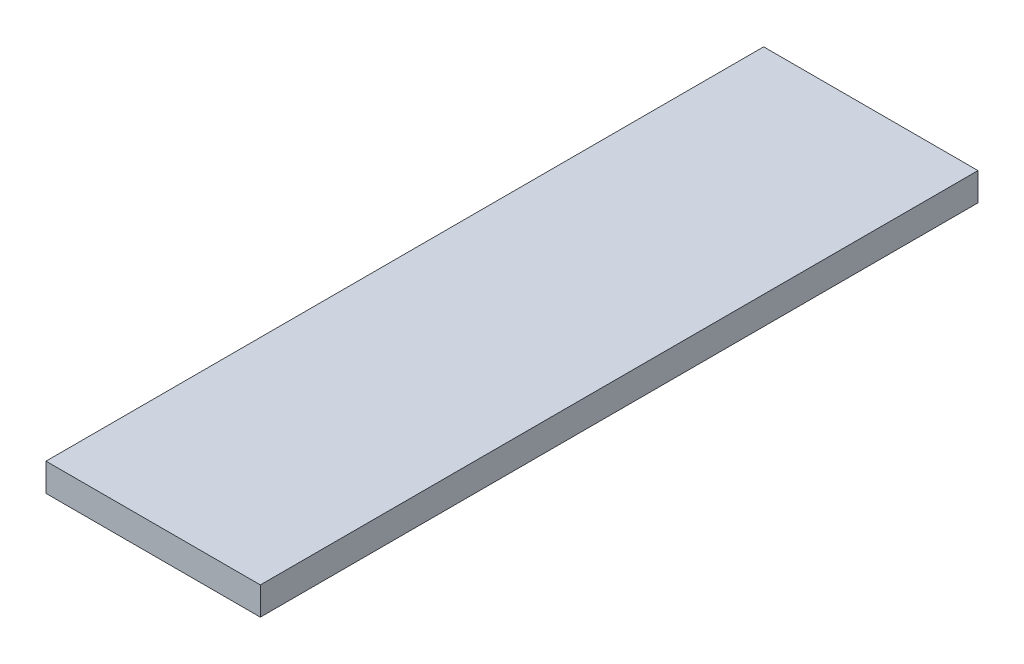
from build123d import *

# Parameters (mm, degrees)
SKETCH1_W           = 292.1
SKETCH1_H           = 977.9
BOSS_EXTRUDE1_DEPTH = 38.1


with BuildPart() as part:
    # Sketch1 → Boss-Extrude1 (new body)
    with BuildSketch(Plane(origin=(0, 0, 0), x_dir=(1, 0, 0), z_dir=(0, 1, 0))):
        with Locations((-146.05, -488.95)):
            Rectangle(SKETCH1_W, SKETCH1_H)
    extrude(amount=BOSS_EXTRUDE1_DEPTH)


solid = part.part
